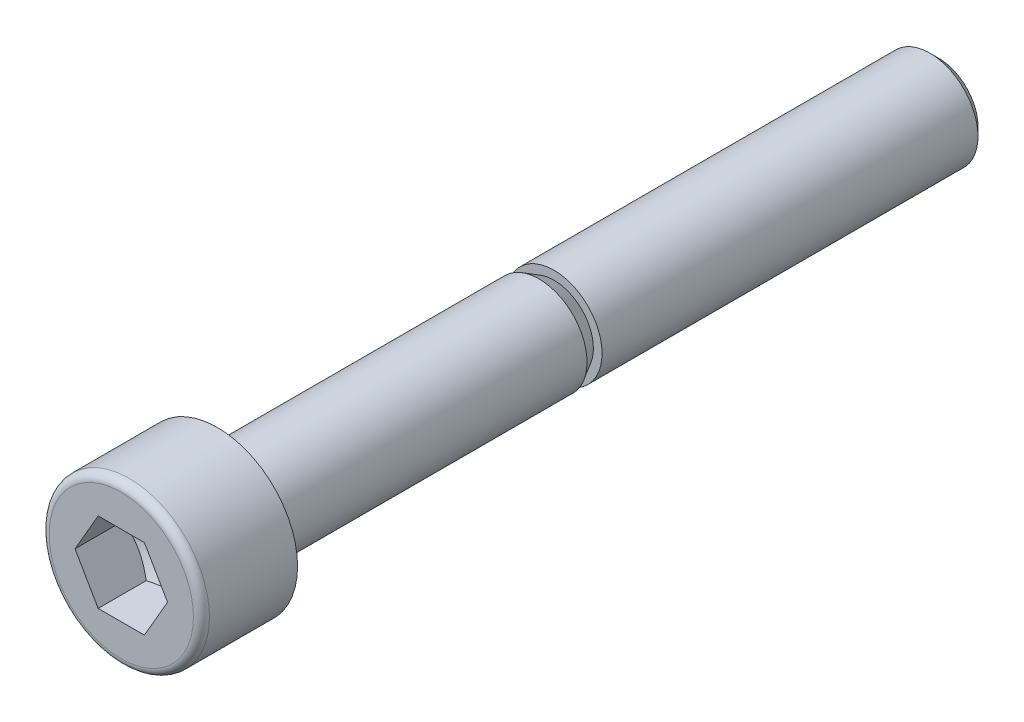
ISO-10303-21;
HEADER;
FILE_DESCRIPTION(('STEP AP214'),'2;1');
FILE_NAME('part.step','',(''),(''),'','','');
FILE_SCHEMA(('AUTOMOTIVE_DESIGN { 1 0 10303 214 1 1 1 1 }'));
ENDSEC;
DATA;
#1=APPLICATION_CONTEXT('core data for automotive mechanical design processes');
#2=APPLICATION_PROTOCOL_DEFINITION('international standard','automotive_design',2000,#1);
#3=PRODUCT_CONTEXT('',#1,'mechanical');
#4=PRODUCT('Part','Part','',(#3));
#5=PRODUCT_RELATED_PRODUCT_CATEGORY('part','',(#4));
#6=PRODUCT_DEFINITION_FORMATION('','',#4);
#7=PRODUCT_DEFINITION_CONTEXT('part definition',#1,'design');
#8=PRODUCT_DEFINITION('design','',#6,#7);
#9=PRODUCT_DEFINITION_SHAPE('','',#8);
#10=(LENGTH_UNIT() NAMED_UNIT(*) SI_UNIT(.MILLI.,.METRE.));
#11=(NAMED_UNIT(*) PLANE_ANGLE_UNIT() SI_UNIT($,.RADIAN.));
#12=(NAMED_UNIT(*) SI_UNIT($,.STERADIAN.) SOLID_ANGLE_UNIT());
#13=UNCERTAINTY_MEASURE_WITH_UNIT(LENGTH_MEASURE(1.E-05),#10,'distance_accuracy_value','');
#14=(GEOMETRIC_REPRESENTATION_CONTEXT(3) GLOBAL_UNCERTAINTY_ASSIGNED_CONTEXT((#13)) GLOBAL_UNIT_ASSIGNED_CONTEXT((#10,
#11,#12)) REPRESENTATION_CONTEXT('',''));
#15=CARTESIAN_POINT('',(0.,0.,0.));
#16=DIRECTION('',(0.,0.,1.));
#17=DIRECTION('',(1.,0.,0.));
#18=AXIS2_PLACEMENT_3D('',#15,#16,#17);
#19=CARTESIAN_POINT('',(0.,0.,6.));
#20=DIRECTION('',(0.,0.,1.));
#21=DIRECTION('',(1.,0.,0.));
#22=AXIS2_PLACEMENT_3D('',#19,#20,#21);
#23=PLANE('',#22);
#24=CARTESIAN_POINT('',(0.,0.,6.));
#25=DIRECTION('',(0.,0.,1.));
#26=DIRECTION('',(1.,0.,0.));
#27=AXIS2_PLACEMENT_3D('',#24,#25,#26);
#28=CIRCLE('',#27,4.5);
#29=CARTESIAN_POINT('',(4.5,0.,6.));
#30=VERTEX_POINT('',#29);
#31=EDGE_CURVE('E11',#30,#30,#28,.T.);
#32=ORIENTED_EDGE('',*,*,#31,.T.);
#33=EDGE_LOOP('',(#32));
#34=FACE_BOUND('',#33,.T.);
#35=DIRECTION('',(1.,0.,0.));
#36=VECTOR('',#35,1.);
#37=CARTESIAN_POINT('',(-1.443375,2.49999883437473,6.));
#38=LINE('',#37,#36);
#39=CARTESIAN_POINT('',(-1.443375,2.49999883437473,6.));
#40=VERTEX_POINT('',#39);
#41=CARTESIAN_POINT('',(1.443375,2.49999883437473,6.));
#42=VERTEX_POINT('',#41);
#43=EDGE_CURVE('E92',#40,#42,#38,.T.);
#44=ORIENTED_EDGE('',*,*,#43,.T.);
#45=DIRECTION('',(0.5,-0.866025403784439,0.));
#46=VECTOR('',#45,1.);
#47=CARTESIAN_POINT('',(1.443375,2.49999883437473,6.));
#48=LINE('',#47,#46);
#49=CARTESIAN_POINT('',(2.88675,0.,6.));
#50=VERTEX_POINT('',#49);
#51=EDGE_CURVE('E31',#42,#50,#48,.T.);
#52=ORIENTED_EDGE('',*,*,#51,.T.);
#53=DIRECTION('',(-0.5,-0.866025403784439,0.));
#54=VECTOR('',#53,1.);
#55=CARTESIAN_POINT('',(2.88675,0.,6.));
#56=LINE('',#55,#54);
#57=CARTESIAN_POINT('',(1.443375,-2.49999883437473,6.));
#58=VERTEX_POINT('',#57);
#59=EDGE_CURVE('E169',#50,#58,#56,.T.);
#60=ORIENTED_EDGE('',*,*,#59,.T.);
#61=DIRECTION('',(-1.,0.,0.));
#62=VECTOR('',#61,1.);
#63=CARTESIAN_POINT('',(1.443375,-2.49999883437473,6.));
#64=LINE('',#63,#62);
#65=CARTESIAN_POINT('',(-1.443375,-2.49999883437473,6.));
#66=VERTEX_POINT('',#65);
#67=EDGE_CURVE('E165',#58,#66,#64,.T.);
#68=ORIENTED_EDGE('',*,*,#67,.T.);
#69=DIRECTION('',(-0.5,0.866025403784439,0.));
#70=VECTOR('',#69,1.);
#71=CARTESIAN_POINT('',(-1.443375,-2.49999883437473,6.));
#72=LINE('',#71,#70);
#73=CARTESIAN_POINT('',(-2.88675,0.,6.));
#74=VERTEX_POINT('',#73);
#75=EDGE_CURVE('E160',#66,#74,#72,.T.);
#76=ORIENTED_EDGE('',*,*,#75,.T.);
#77=DIRECTION('',(0.5,0.866025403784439,0.));
#78=VECTOR('',#77,1.);
#79=CARTESIAN_POINT('',(-2.88675,0.,6.));
#80=LINE('',#79,#78);
#81=EDGE_CURVE('E96',#74,#40,#80,.T.);
#82=ORIENTED_EDGE('',*,*,#81,.T.);
#83=EDGE_LOOP('',(#44,#52,#60,#68,#76,#82));
#84=FACE_BOUND('',#83,.T.);
#85=ADVANCED_FACE('F17',(#34,#84),#23,.T.);
#86=CARTESIAN_POINT('',(0.,0.,5.5));
#87=DIRECTION('',(0.,0.,1.));
#88=DIRECTION('',(1.,0.,0.));
#89=AXIS2_PLACEMENT_3D('',#86,#87,#88);
#90=TOROIDAL_SURFACE('',#89,4.5,0.5);
#91=ORIENTED_EDGE('',*,*,#31,.F.);
#92=EDGE_LOOP('',(#91));
#93=FACE_BOUND('',#92,.T.);
#94=CARTESIAN_POINT('',(0.,0.,5.5));
#95=DIRECTION('',(0.,0.,1.));
#96=DIRECTION('',(1.,0.,0.));
#97=AXIS2_PLACEMENT_3D('',#94,#95,#96);
#98=CIRCLE('',#97,5.);
#99=CARTESIAN_POINT('',(5.,0.,5.5));
#100=VERTEX_POINT('',#99);
#101=EDGE_CURVE('E24',#100,#100,#98,.T.);
#102=ORIENTED_EDGE('',*,*,#101,.T.);
#103=EDGE_LOOP('',(#102));
#104=FACE_BOUND('',#103,.T.);
#105=ADVANCED_FACE('F133',(#93,#104),#90,.T.);
#106=CARTESIAN_POINT('',(0.,0.,6.));
#107=DIRECTION('',(0.,0.,1.));
#108=DIRECTION('',(1.,0.,0.));
#109=AXIS2_PLACEMENT_3D('',#106,#107,#108);
#110=CYLINDRICAL_SURFACE('',#109,5.);
#111=CARTESIAN_POINT('',(0.,0.,0.));
#112=DIRECTION('',(0.,0.,1.));
#113=DIRECTION('',(1.,0.,0.));
#114=AXIS2_PLACEMENT_3D('',#111,#112,#113);
#115=CIRCLE('',#114,5.);
#116=CARTESIAN_POINT('',(5.,0.,0.));
#117=VERTEX_POINT('',#116);
#118=EDGE_CURVE('E128',#117,#117,#115,.T.);
#119=ORIENTED_EDGE('',*,*,#118,.T.);
#120=EDGE_LOOP('',(#119));
#121=FACE_BOUND('',#120,.T.);
#122=ORIENTED_EDGE('',*,*,#101,.F.);
#123=EDGE_LOOP('',(#122));
#124=FACE_BOUND('',#123,.T.);
#125=ADVANCED_FACE('F135',(#121,#124),#110,.T.);
#126=CARTESIAN_POINT('',(0.,5.,0.));
#127=DIRECTION('',(0.,0.,-1.));
#128=DIRECTION('',(-1.,0.,0.));
#129=AXIS2_PLACEMENT_3D('',#126,#127,#128);
#130=PLANE('',#129);
#131=CARTESIAN_POINT('',(0.,0.,0.));
#132=DIRECTION('',(0.,0.,1.));
#133=DIRECTION('',(1.,0.,0.));
#134=AXIS2_PLACEMENT_3D('',#131,#132,#133);
#135=CIRCLE('',#134,3.3);
#136=CARTESIAN_POINT('',(3.3,0.,0.));
#137=VERTEX_POINT('',#136);
#138=EDGE_CURVE('E125',#137,#137,#135,.T.);
#139=ORIENTED_EDGE('',*,*,#138,.T.);
#140=EDGE_LOOP('',(#139));
#141=FACE_BOUND('',#140,.T.);
#142=ORIENTED_EDGE('',*,*,#118,.F.);
#143=EDGE_LOOP('',(#142));
#144=FACE_BOUND('',#143,.T.);
#145=ADVANCED_FACE('F137',(#141,#144),#130,.T.);
#146=CARTESIAN_POINT('',(0.,0.,-0.3));
#147=DIRECTION('',(0.,0.,1.));
#148=DIRECTION('',(1.,0.,0.));
#149=AXIS2_PLACEMENT_3D('',#146,#147,#148);
#150=TOROIDAL_SURFACE('',#149,3.3,0.3);
#151=CARTESIAN_POINT('',(0.,0.,-0.3));
#152=DIRECTION('',(0.,0.,1.));
#153=DIRECTION('',(1.,0.,0.));
#154=AXIS2_PLACEMENT_3D('',#151,#152,#153);
#155=CIRCLE('',#154,3.);
#156=CARTESIAN_POINT('',(3.,0.,-0.3));
#157=VERTEX_POINT('',#156);
#158=EDGE_CURVE('E122',#157,#157,#155,.T.);
#159=ORIENTED_EDGE('',*,*,#158,.T.);
#160=EDGE_LOOP('',(#159));
#161=FACE_BOUND('',#160,.T.);
#162=ORIENTED_EDGE('',*,*,#138,.F.);
#163=EDGE_LOOP('',(#162));
#164=FACE_BOUND('',#163,.T.);
#165=ADVANCED_FACE('F145',(#161,#164),#150,.F.);
#166=CARTESIAN_POINT('',(0.,0.,6.));
#167=DIRECTION('',(0.,0.,1.));
#168=DIRECTION('',(1.,0.,0.));
#169=AXIS2_PLACEMENT_3D('',#166,#167,#168);
#170=CYLINDRICAL_SURFACE('',#169,3.);
#171=CARTESIAN_POINT('',(0.,0.,-20.0625275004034));
#172=DIRECTION('',(0.,0.,1.));
#173=DIRECTION('',(1.,0.,0.));
#174=AXIS2_PLACEMENT_3D('',#171,#172,#173);
#175=CIRCLE('',#174,3.);
#176=CARTESIAN_POINT('',(3.,0.,-20.0625275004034));
#177=VERTEX_POINT('',#176);
#178=EDGE_CURVE('E119',#177,#177,#175,.T.);
#179=ORIENTED_EDGE('',*,*,#178,.T.);
#180=EDGE_LOOP('',(#179));
#181=FACE_BOUND('',#180,.T.);
#182=ORIENTED_EDGE('',*,*,#158,.F.);
#183=EDGE_LOOP('',(#182));
#184=FACE_BOUND('',#183,.T.);
#185=ADVANCED_FACE('F316',(#181,#184),#170,.T.);
#186=CARTESIAN_POINT('',(0.,0.,-20.0625275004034));
#187=DIRECTION('',(0.,0.,1.));
#188=DIRECTION('',(1.,0.,0.));
#189=AXIS2_PLACEMENT_3D('',#186,#187,#188);
#190=CONICAL_SURFACE('',#189,3.,0.523598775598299);
#191=CARTESIAN_POINT('',(0.,0.,-21.));
#192=DIRECTION('',(0.,0.,1.));
#193=DIRECTION('',(1.,0.,0.));
#194=AXIS2_PLACEMENT_3D('',#191,#192,#193);
#195=CIRCLE('',#194,2.45875);
#196=CARTESIAN_POINT('',(2.45875,0.,-21.));
#197=VERTEX_POINT('',#196);
#198=EDGE_CURVE('E116',#197,#197,#195,.T.);
#199=ORIENTED_EDGE('',*,*,#198,.T.);
#200=EDGE_LOOP('',(#199));
#201=FACE_BOUND('',#200,.T.);
#202=ORIENTED_EDGE('',*,*,#178,.F.);
#203=EDGE_LOOP('',(#202));
#204=FACE_BOUND('',#203,.T.);
#205=ADVANCED_FACE('F308',(#201,#204),#190,.T.);
#206=CARTESIAN_POINT('',(0.,2.45875,-21.));
#207=DIRECTION('',(0.,0.,1.));
#208=DIRECTION('',(1.,0.,0.));
#209=AXIS2_PLACEMENT_3D('',#206,#207,#208);
#210=PLANE('',#209);
#211=CARTESIAN_POINT('',(0.,0.,-21.));
#212=DIRECTION('',(0.,0.,1.));
#213=DIRECTION('',(1.,0.,0.));
#214=AXIS2_PLACEMENT_3D('',#211,#212,#213);
#215=CIRCLE('',#214,3.);
#216=CARTESIAN_POINT('',(3.,0.,-21.));
#217=VERTEX_POINT('',#216);
#218=EDGE_CURVE('E113',#217,#217,#215,.T.);
#219=ORIENTED_EDGE('',*,*,#218,.T.);
#220=EDGE_LOOP('',(#219));
#221=FACE_BOUND('',#220,.T.);
#222=ORIENTED_EDGE('',*,*,#198,.F.);
#223=EDGE_LOOP('',(#222));
#224=FACE_BOUND('',#223,.T.);
#225=ADVANCED_FACE('F298',(#221,#224),#210,.T.);
#226=CARTESIAN_POINT('',(0.,0.,6.));
#227=DIRECTION('',(0.,0.,1.));
#228=DIRECTION('',(1.,0.,0.));
#229=AXIS2_PLACEMENT_3D('',#226,#227,#228);
#230=CYLINDRICAL_SURFACE('',#229,3.);
#231=CARTESIAN_POINT('',(0.,0.,-44.45875));
#232=DIRECTION('',(0.,0.,1.));
#233=DIRECTION('',(1.,0.,0.));
#234=AXIS2_PLACEMENT_3D('',#231,#232,#233);
#235=CIRCLE('',#234,3.);
#236=CARTESIAN_POINT('',(3.,0.,-44.45875));
#237=VERTEX_POINT('',#236);
#238=EDGE_CURVE('E110',#237,#237,#235,.T.);
#239=ORIENTED_EDGE('',*,*,#238,.T.);
#240=EDGE_LOOP('',(#239));
#241=FACE_BOUND('',#240,.T.);
#242=ORIENTED_EDGE('',*,*,#218,.F.);
#243=EDGE_LOOP('',(#242));
#244=FACE_BOUND('',#243,.T.);
#245=ADVANCED_FACE('F288',(#241,#244),#230,.T.);
#246=CARTESIAN_POINT('',(0.,0.,-44.45875));
#247=DIRECTION('',(0.,0.,1.));
#248=DIRECTION('',(1.,0.,0.));
#249=AXIS2_PLACEMENT_3D('',#246,#247,#248);
#250=CONICAL_SURFACE('',#249,3.,0.78539816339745);
#251=CARTESIAN_POINT('',(0.,0.,-45.));
#252=DIRECTION('',(0.,0.,1.));
#253=DIRECTION('',(1.,0.,0.));
#254=AXIS2_PLACEMENT_3D('',#251,#252,#253);
#255=CIRCLE('',#254,2.45875);
#256=CARTESIAN_POINT('',(2.45875,0.,-45.));
#257=VERTEX_POINT('',#256);
#258=EDGE_CURVE('E107',#257,#257,#255,.T.);
#259=ORIENTED_EDGE('',*,*,#258,.T.);
#260=EDGE_LOOP('',(#259));
#261=FACE_BOUND('',#260,.T.);
#262=ORIENTED_EDGE('',*,*,#238,.F.);
#263=EDGE_LOOP('',(#262));
#264=FACE_BOUND('',#263,.T.);
#265=ADVANCED_FACE('F281',(#261,#264),#250,.T.);
#266=CARTESIAN_POINT('',(0.,2.45875,-45.));
#267=DIRECTION('',(0.,0.,-1.));
#268=DIRECTION('',(-1.,0.,0.));
#269=AXIS2_PLACEMENT_3D('',#266,#267,#268);
#270=PLANE('',#269);
#271=ORIENTED_EDGE('',*,*,#258,.F.);
#272=EDGE_LOOP('',(#271));
#273=FACE_BOUND('',#272,.T.);
#274=ADVANCED_FACE('F225',(#273),#270,.T.);
#275=CARTESIAN_POINT('',(1.443375,2.49999883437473,1.33333411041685));
#276=DIRECTION('',(-0.866025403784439,-0.5,0.));
#277=DIRECTION('',(-0.5,0.866025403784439,0.));
#278=AXIS2_PLACEMENT_3D('',#275,#276,#277);
#279=PLANE('',#278);
#280=DIRECTION('',(0.,0.,1.));
#281=VECTOR('',#280,1.);
#282=CARTESIAN_POINT('',(2.88675,0.,1.33333411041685));
#283=LINE('',#282,#281);
#284=CARTESIAN_POINT('',(2.88675,0.,3.));
#285=VERTEX_POINT('',#284);
#286=EDGE_CURVE('E105',#285,#50,#283,.T.);
#287=ORIENTED_EDGE('',*,*,#286,.T.);
#288=ORIENTED_EDGE('',*,*,#51,.F.);
#289=DIRECTION('',(0.,0.,1.));
#290=VECTOR('',#289,1.);
#291=CARTESIAN_POINT('',(1.443375,2.49999883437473,1.33333411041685));
#292=LINE('',#291,#290);
#293=CARTESIAN_POINT('',(1.443375,2.49999883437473,3.));
#294=VERTEX_POINT('',#293);
#295=EDGE_CURVE('E86',#294,#42,#292,.T.);
#296=ORIENTED_EDGE('',*,*,#295,.F.);
#297=CARTESIAN_POINT('',(2.88675011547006,-1.99999999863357E-07,3.00000006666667));
#298=CARTESIAN_POINT('',(2.82332252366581,0.109859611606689,2.96336950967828));
#299=CARTESIAN_POINT('',(2.75934742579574,0.22066773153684,2.93005593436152));
#300=CARTESIAN_POINT('',(2.63028954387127,0.444202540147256,2.87190808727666));
#301=CARTESIAN_POINT('',(2.56520446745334,0.556933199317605,2.84709438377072));
#302=CARTESIAN_POINT('',(2.43584088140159,0.780997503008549,2.80847006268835));
#303=CARTESIAN_POINT('',(2.37158227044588,0.892296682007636,2.7944023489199));
#304=CARTESIAN_POINT('',(2.24276284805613,1.11541846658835,2.77761157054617));
#305=CARTESIAN_POINT('',(2.17820250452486,1.22724026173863,2.77487459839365));
#306=CARTESIAN_POINT('',(2.05757841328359,1.43616731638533,2.78058295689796));
#307=CARTESIAN_POINT('',(2.00149656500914,1.53330392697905,2.7876266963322));
#308=CARTESIAN_POINT('',(1.8896982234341,1.72694433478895,2.80994670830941));
#309=CARTESIAN_POINT('',(1.83398211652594,1.82344746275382,2.82523059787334));
#310=CARTESIAN_POINT('',(1.72195345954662,2.01748678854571,2.86343736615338));
#311=CARTESIAN_POINT('',(1.66565508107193,2.11499844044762,2.88652212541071));
#312=CARTESIAN_POINT('',(1.55389777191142,2.3085677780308,2.93891477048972));
#313=CARTESIAN_POINT('',(1.49843741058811,2.40462794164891,2.96821035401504));
#314=CARTESIAN_POINT('',(1.44337488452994,2.49999903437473,3.00000006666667));
#315=B_SPLINE_CURVE_WITH_KNOTS('',3,(#297,#298,#299,#300,#301,#302,#303,#304,#305,#306,#307,
#308,#309,#310,#311,#312,#313,#314),.UNSPECIFIED.,.F.,.F.,(4,2,2,2,2,2,2,2,4),(0.,
0.396269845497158,0.793491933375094,1.18088400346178,1.56780044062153,1.90463400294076,
2.24177946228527,2.58640119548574,2.93034658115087),.UNSPECIFIED.);
#316=EDGE_CURVE('E79',#285,#294,#315,.T.);
#317=ORIENTED_EDGE('',*,*,#316,.F.);
#318=EDGE_LOOP('',(#287,#288,#296,#317));
#319=FACE_BOUND('',#318,.T.);
#320=ADVANCED_FACE('F87',(#319),#279,.T.);
#321=CARTESIAN_POINT('',(2.88675,0.,1.33333411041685));
#322=DIRECTION('',(-0.866025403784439,0.5,0.));
#323=DIRECTION('',(0.5,0.866025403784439,0.));
#324=AXIS2_PLACEMENT_3D('',#321,#322,#323);
#325=PLANE('',#324);
#326=DIRECTION('',(0.,0.,1.));
#327=VECTOR('',#326,1.);
#328=CARTESIAN_POINT('',(1.443375,-2.49999883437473,1.33333411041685));
#329=LINE('',#328,#327);
#330=CARTESIAN_POINT('',(1.443375,-2.49999883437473,3.));
#331=VERTEX_POINT('',#330);
#332=EDGE_CURVE('E103',#331,#58,#329,.T.);
#333=ORIENTED_EDGE('',*,*,#332,.T.);
#334=ORIENTED_EDGE('',*,*,#59,.F.);
#335=ORIENTED_EDGE('',*,*,#286,.F.);
#336=CARTESIAN_POINT('',(1.44337488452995,-2.49999903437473,3.00000006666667));
#337=CARTESIAN_POINT('',(1.50680247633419,-2.39013922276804,2.96336950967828));
#338=CARTESIAN_POINT('',(1.57077757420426,-2.27933110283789,2.93005593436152));
#339=CARTESIAN_POINT('',(1.69983545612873,-2.05579629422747,2.87190808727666));
#340=CARTESIAN_POINT('',(1.76492053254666,-1.94306563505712,2.84709438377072));
#341=CARTESIAN_POINT('',(1.89428411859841,-1.71900133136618,2.80847006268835));
#342=CARTESIAN_POINT('',(1.95854272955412,-1.60770215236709,2.7944023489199));
#343=CARTESIAN_POINT('',(2.08736215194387,-1.38458036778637,2.77761157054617));
#344=CARTESIAN_POINT('',(2.15192249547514,-1.2727585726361,2.77487459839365));
#345=CARTESIAN_POINT('',(2.27254658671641,-1.06383151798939,2.78058295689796));
#346=CARTESIAN_POINT('',(2.32862843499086,-0.966694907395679,2.7876266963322));
#347=CARTESIAN_POINT('',(2.4404267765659,-0.773054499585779,2.8099467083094));
#348=CARTESIAN_POINT('',(2.49614288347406,-0.676551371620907,2.82523059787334));
#349=CARTESIAN_POINT('',(2.60817154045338,-0.48251204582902,2.86343736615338));
#350=CARTESIAN_POINT('',(2.66446991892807,-0.385000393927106,2.88652212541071));
#351=CARTESIAN_POINT('',(2.77622722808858,-0.191431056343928,2.93891477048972));
#352=CARTESIAN_POINT('',(2.83168758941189,-0.0953708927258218,2.96821035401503));
#353=CARTESIAN_POINT('',(2.88675011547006,1.99999999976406E-07,3.00000006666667));
#354=B_SPLINE_CURVE_WITH_KNOTS('',3,(#336,#337,#338,#339,#340,#341,#342,#343,#344,#345,#346,
#347,#348,#349,#350,#351,#352,#353),.UNSPECIFIED.,.F.,.F.,(4,2,2,2,2,2,2,2,4),(0.,
0.396269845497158,0.793491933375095,1.18088400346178,1.56780044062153,1.90463400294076,
2.24177946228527,2.58640119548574,2.93034658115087),.UNSPECIFIED.);
#355=EDGE_CURVE('E83',#331,#285,#354,.T.);
#356=ORIENTED_EDGE('',*,*,#355,.F.);
#357=EDGE_LOOP('',(#333,#334,#335,#356));
#358=FACE_BOUND('',#357,.T.);
#359=ADVANCED_FACE('F216',(#358),#325,.T.);
#360=CARTESIAN_POINT('',(1.443375,-2.49999883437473,1.33333411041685));
#361=DIRECTION('',(0.,1.,0.));
#362=DIRECTION('',(1.,0.,0.));
#363=AXIS2_PLACEMENT_3D('',#360,#361,#362);
#364=PLANE('',#363);
#365=DIRECTION('',(0.,0.,1.));
#366=VECTOR('',#365,1.);
#367=CARTESIAN_POINT('',(-1.443375,-2.49999883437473,1.33333411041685));
#368=LINE('',#367,#366);
#369=CARTESIAN_POINT('',(-1.443375,-2.49999883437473,3.));
#370=VERTEX_POINT('',#369);
#371=EDGE_CURVE('E101',#370,#66,#368,.T.);
#372=ORIENTED_EDGE('',*,*,#371,.T.);
#373=ORIENTED_EDGE('',*,*,#67,.F.);
#374=ORIENTED_EDGE('',*,*,#332,.F.);
#375=CARTESIAN_POINT('',(-3.73786106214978,-2.49999883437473,3.92958778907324));
#376=CARTESIAN_POINT('',(-3.62990250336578,-2.49999883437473,3.87779335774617));
#377=CARTESIAN_POINT('',(-3.52168094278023,-2.49999883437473,3.82653690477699));
#378=CARTESIAN_POINT('',(-3.30457164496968,-2.49999883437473,3.72540514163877));
#379=CARTESIAN_POINT('',(-3.1956837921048,-2.49999883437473,3.67553008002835));
#380=CARTESIAN_POINT('',(-2.97647740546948,-2.49999883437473,3.57718765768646));
#381=CARTESIAN_POINT('',(-2.86615419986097,-2.49999883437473,3.52873067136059));
#382=CARTESIAN_POINT('',(-2.64458202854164,-2.49999883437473,3.43398963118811));
#383=CARTESIAN_POINT('',(-2.5333331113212,-2.49999883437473,3.38770546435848));
#384=CARTESIAN_POINT('',(-2.30680205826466,-2.49999883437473,3.29671007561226));
#385=CARTESIAN_POINT('',(-2.19149052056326,-2.49999883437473,3.25207161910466));
#386=CARTESIAN_POINT('',(-1.95947266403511,-2.49999883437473,3.16650598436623));
#387=CARTESIAN_POINT('',(-1.84276618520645,-2.49999883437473,3.12557923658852));
#388=CARTESIAN_POINT('',(-1.60804233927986,-2.49999883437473,3.04860739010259));
#389=CARTESIAN_POINT('',(-1.49002871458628,-2.49999883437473,3.01255100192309));
#390=CARTESIAN_POINT('',(-1.25231014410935,-2.49999883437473,2.94655294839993));
#391=CARTESIAN_POINT('',(-1.13260562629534,-2.49999883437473,2.91660976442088));
#392=CARTESIAN_POINT('',(-0.891754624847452,-2.49999883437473,2.86443431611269));
#393=CARTESIAN_POINT('',(-0.770611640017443,-2.49999883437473,2.84218621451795));
#394=CARTESIAN_POINT('',(-0.526970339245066,-2.49999883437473,2.80685777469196));
#395=CARTESIAN_POINT('',(-0.404472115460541,-2.49999883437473,2.79377681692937));
#396=CARTESIAN_POINT('',(-0.160266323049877,-2.49999883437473,2.77799632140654));
#397=CARTESIAN_POINT('',(-0.0385668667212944,-2.49999883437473,2.77517427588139));
#398=CARTESIAN_POINT('',(0.204641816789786,-2.49999883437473,2.77983589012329));
#399=CARTESIAN_POINT('',(0.326151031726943,-2.49999883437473,2.78732018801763));
#400=CARTESIAN_POINT('',(0.536550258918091,-2.49999883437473,2.80869871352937));
#401=CARTESIAN_POINT('',(0.62567290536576,-2.49999883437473,2.82040889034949));
#402=CARTESIAN_POINT('',(0.803172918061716,-2.49999883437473,2.84856827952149));
#403=CARTESIAN_POINT('',(0.891550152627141,-2.49999883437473,2.86501831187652));
#404=CARTESIAN_POINT('',(1.15551819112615,-2.49999883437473,2.92060817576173));
#405=CARTESIAN_POINT('',(1.32980784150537,-2.49999883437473,2.96597208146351));
#406=CARTESIAN_POINT('',(1.59042319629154,-2.49999883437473,3.04347409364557));
#407=CARTESIAN_POINT('',(1.67812270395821,-2.49999883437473,3.07124565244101));
#408=CARTESIAN_POINT('',(1.85261386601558,-2.49999883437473,3.12935698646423));
#409=CARTESIAN_POINT('',(1.93940604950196,-2.49999883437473,3.15969515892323));
#410=CARTESIAN_POINT('',(2.11219208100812,-2.49999883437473,3.22250012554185));
#411=CARTESIAN_POINT('',(2.19818607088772,-2.49999883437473,3.25496653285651));
#412=CARTESIAN_POINT('',(2.36949689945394,-2.49999883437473,3.32167630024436));
#413=CARTESIAN_POINT('',(2.45481362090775,-2.49999883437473,3.3559199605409));
#414=CARTESIAN_POINT('',(2.67258663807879,-2.49999883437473,3.44552247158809));
#415=CARTESIAN_POINT('',(2.80460718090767,-2.49999883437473,3.50193902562));
#416=CARTESIAN_POINT('',(3.06745885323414,-2.49999883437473,3.61748625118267));
#417=CARTESIAN_POINT('',(3.19828989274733,-2.49999883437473,3.67661712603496));
#418=CARTESIAN_POINT('',(3.45900849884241,-2.49999883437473,3.79697660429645));
#419=CARTESIAN_POINT('',(3.58889589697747,-2.49999883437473,3.85820557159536));
#420=CARTESIAN_POINT('',(3.84788845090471,-2.49999883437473,3.98229868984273));
#421=CARTESIAN_POINT('',(3.97699358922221,-2.49999883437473,4.04516287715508));
#422=CARTESIAN_POINT('',(4.36366789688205,-2.49999883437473,4.2358316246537));
#423=CARTESIAN_POINT('',(4.62028438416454,-2.49999883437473,4.36556637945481));
#424=CARTESIAN_POINT('',(5.1317603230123,-2.49999883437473,4.62835381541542));
#425=CARTESIAN_POINT('',(5.3866199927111,-2.49999883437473,4.76140607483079));
#426=CARTESIAN_POINT('',(5.87112445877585,-2.49999883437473,5.01714627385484));
#427=CARTESIAN_POINT('',(6.10087872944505,-2.49999883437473,5.13962714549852));
#428=CARTESIAN_POINT('',(6.55964828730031,-2.49999883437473,5.3859833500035));
#429=CARTESIAN_POINT('',(6.78866354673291,-2.49999883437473,5.5098587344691));
#430=CARTESIAN_POINT('',(7.24554286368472,-2.49999883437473,5.75833893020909));
#431=CARTESIAN_POINT('',(7.47340836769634,-2.49999883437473,5.88294108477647));
#432=CARTESIAN_POINT('',(7.92867868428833,-2.49999883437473,6.13295637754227));
#433=CARTESIAN_POINT('',(8.15608352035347,-2.49999883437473,6.25836947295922));
#434=CARTESIAN_POINT('',(8.38332285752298,-2.49999883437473,6.38407980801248));
#435=B_SPLINE_CURVE_WITH_KNOTS('',3,(#375,#376,#377,#378,#379,#380,#381,#382,#383,#384,#385,
#386,#387,#388,#389,#390,#391,#392,#393,#394,#395,#396,#397,#398,#399,#400,#401,#402,#403,#404,
#405,#406,#407,#408,#409,#410,#411,#412,#413,#414,#415,#416,#417,#418,#419,#420,#421,#422,#423,
#424,#425,#426,#427,#428,#429,#430,#431,#432,#433,#434),.UNSPECIFIED.,.F.,.F.,(4,2,2,2,2,2,2,2,
2,2,2,2,2,2,2,2,2,2,2,2,2,2,2,2,2,2,2,2,2,4),(0.,0.359225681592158,0.718515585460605,
1.07998495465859,1.44143550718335,1.81233642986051,2.18328031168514,2.55334902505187,
2.92332569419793,3.29253631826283,3.66172198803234,4.02648423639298,4.39126907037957,
4.66080188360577,4.93038135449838,5.46995360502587,5.74590907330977,6.02169347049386,
6.29742787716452,6.5732090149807,7.00387398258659,7.43457126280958,7.86534362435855,
8.29612557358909,9.15872149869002,10.0212083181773,10.8022890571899,11.583398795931,
12.3625217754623,13.1416039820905),.UNSPECIFIED.);
#436=EDGE_CURVE('E207',#370,#331,#435,.T.);
#437=ORIENTED_EDGE('',*,*,#436,.F.);
#438=EDGE_LOOP('',(#372,#373,#374,#437));
#439=FACE_BOUND('',#438,.T.);
#440=ADVANCED_FACE('F212',(#439),#364,.T.);
#441=CARTESIAN_POINT('',(-1.443375,-2.49999883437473,1.33333411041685));
#442=DIRECTION('',(0.866025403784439,0.5,0.));
#443=DIRECTION('',(0.5,-0.866025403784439,0.));
#444=AXIS2_PLACEMENT_3D('',#441,#442,#443);
#445=PLANE('',#444);
#446=DIRECTION('',(0.,0.,1.));
#447=VECTOR('',#446,1.);
#448=CARTESIAN_POINT('',(-2.88675,0.,1.33333411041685));
#449=LINE('',#448,#447);
#450=CARTESIAN_POINT('',(-2.88675,0.,3.));
#451=VERTEX_POINT('',#450);
#452=EDGE_CURVE('E94',#451,#74,#449,.T.);
#453=ORIENTED_EDGE('',*,*,#452,.T.);
#454=ORIENTED_EDGE('',*,*,#75,.F.);
#455=ORIENTED_EDGE('',*,*,#371,.F.);
#456=CARTESIAN_POINT('',(-2.88675011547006,2.E-07,3.00000006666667));
#457=CARTESIAN_POINT('',(-2.82332252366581,-0.109859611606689,2.96336950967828));
#458=CARTESIAN_POINT('',(-2.75934742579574,-0.220667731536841,2.93005593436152));
#459=CARTESIAN_POINT('',(-2.63028954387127,-0.444202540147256,2.87190808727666));
#460=CARTESIAN_POINT('',(-2.56520446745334,-0.556933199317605,2.84709438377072));
#461=CARTESIAN_POINT('',(-2.43584088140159,-0.780997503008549,2.80847006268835));
#462=CARTESIAN_POINT('',(-2.37158227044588,-0.892296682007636,2.7944023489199));
#463=CARTESIAN_POINT('',(-2.24276284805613,-1.11541846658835,2.77761157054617));
#464=CARTESIAN_POINT('',(-2.17820250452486,-1.22724026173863,2.77487459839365));
#465=CARTESIAN_POINT('',(-2.05757841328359,-1.43616731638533,2.78058295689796));
#466=CARTESIAN_POINT('',(-2.00149656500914,-1.53330392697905,2.7876266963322));
#467=CARTESIAN_POINT('',(-1.8896982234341,-1.72694433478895,2.8099467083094));
#468=CARTESIAN_POINT('',(-1.83398211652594,-1.82344746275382,2.82523059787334));
#469=CARTESIAN_POINT('',(-1.72195345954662,-2.01748678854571,2.86343736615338));
#470=CARTESIAN_POINT('',(-1.66565508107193,-2.11499844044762,2.88652212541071));
#471=CARTESIAN_POINT('',(-1.55389777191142,-2.3085677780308,2.93891477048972));
#472=CARTESIAN_POINT('',(-1.49843741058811,-2.40462794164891,2.96821035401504));
#473=CARTESIAN_POINT('',(-1.44337488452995,-2.49999903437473,3.00000006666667));
#474=B_SPLINE_CURVE_WITH_KNOTS('',3,(#456,#457,#458,#459,#460,#461,#462,#463,#464,#465,#466,
#467,#468,#469,#470,#471,#472,#473),.UNSPECIFIED.,.F.,.F.,(4,2,2,2,2,2,2,2,4),(0.,
0.396269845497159,0.793491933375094,1.18088400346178,1.56780044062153,1.90463400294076,
2.24177946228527,2.58640119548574,2.93034658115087),.UNSPECIFIED.);
#475=EDGE_CURVE('E202',#451,#370,#474,.T.);
#476=ORIENTED_EDGE('',*,*,#475,.F.);
#477=EDGE_LOOP('',(#453,#454,#455,#476));
#478=FACE_BOUND('',#477,.T.);
#479=ADVANCED_FACE('F215',(#478),#445,.T.);
#480=CARTESIAN_POINT('',(-2.88675,0.,1.33333411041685));
#481=DIRECTION('',(0.866025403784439,-0.5,0.));
#482=DIRECTION('',(-0.5,-0.866025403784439,0.));
#483=AXIS2_PLACEMENT_3D('',#480,#481,#482);
#484=PLANE('',#483);
#485=DIRECTION('',(0.,0.,1.));
#486=VECTOR('',#485,1.);
#487=CARTESIAN_POINT('',(-1.443375,2.49999883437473,1.33333411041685));
#488=LINE('',#487,#486);
#489=CARTESIAN_POINT('',(-1.443375,2.49999883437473,3.));
#490=VERTEX_POINT('',#489);
#491=EDGE_CURVE('E91',#490,#40,#488,.T.);
#492=ORIENTED_EDGE('',*,*,#491,.T.);
#493=ORIENTED_EDGE('',*,*,#81,.F.);
#494=ORIENTED_EDGE('',*,*,#452,.F.);
#495=CARTESIAN_POINT('',(-1.44337488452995,2.49999903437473,3.00000006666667));
#496=CARTESIAN_POINT('',(-1.50680247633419,2.39013922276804,2.96336950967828));
#497=CARTESIAN_POINT('',(-1.57077757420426,2.27933110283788,2.93005593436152));
#498=CARTESIAN_POINT('',(-1.69983545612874,2.05579629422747,2.87190808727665));
#499=CARTESIAN_POINT('',(-1.76492053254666,1.94306563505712,2.84709438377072));
#500=CARTESIAN_POINT('',(-1.89428411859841,1.71900133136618,2.80847006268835));
#501=CARTESIAN_POINT('',(-1.95854272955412,1.60770215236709,2.7944023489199));
#502=CARTESIAN_POINT('',(-2.08736215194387,1.38458036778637,2.77761157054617));
#503=CARTESIAN_POINT('',(-2.15192249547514,1.2727585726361,2.77487459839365));
#504=CARTESIAN_POINT('',(-2.27254658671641,1.06383151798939,2.78058295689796));
#505=CARTESIAN_POINT('',(-2.32862843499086,0.966694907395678,2.7876266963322));
#506=CARTESIAN_POINT('',(-2.4404267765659,0.773054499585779,2.8099467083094));
#507=CARTESIAN_POINT('',(-2.49614288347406,0.676551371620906,2.82523059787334));
#508=CARTESIAN_POINT('',(-2.60817154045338,0.48251204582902,2.86343736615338));
#509=CARTESIAN_POINT('',(-2.66446991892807,0.385000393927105,2.88652212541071));
#510=CARTESIAN_POINT('',(-2.77622722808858,0.191431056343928,2.93891477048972));
#511=CARTESIAN_POINT('',(-2.83168758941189,0.0953708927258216,2.96821035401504));
#512=CARTESIAN_POINT('',(-2.88675011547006,-2.00000000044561E-07,3.00000006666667));
#513=B_SPLINE_CURVE_WITH_KNOTS('',3,(#495,#496,#497,#498,#499,#500,#501,#502,#503,#504,#505,
#506,#507,#508,#509,#510,#511,#512),.UNSPECIFIED.,.F.,.F.,(4,2,2,2,2,2,2,2,4),(0.,
0.396269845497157,0.793491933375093,1.18088400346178,1.56780044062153,1.90463400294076,
2.24177946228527,2.58640119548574,2.93034658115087),.UNSPECIFIED.);
#514=EDGE_CURVE('E39',#490,#451,#513,.T.);
#515=ORIENTED_EDGE('',*,*,#514,.F.);
#516=EDGE_LOOP('',(#492,#493,#494,#515));
#517=FACE_BOUND('',#516,.T.);
#518=ADVANCED_FACE('F159',(#517),#484,.T.);
#519=CARTESIAN_POINT('',(-1.443375,2.49999883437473,1.33333411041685));
#520=DIRECTION('',(0.,-1.,0.));
#521=DIRECTION('',(-1.,0.,0.));
#522=AXIS2_PLACEMENT_3D('',#519,#520,#521);
#523=PLANE('',#522);
#524=ORIENTED_EDGE('',*,*,#295,.T.);
#525=ORIENTED_EDGE('',*,*,#43,.F.);
#526=ORIENTED_EDGE('',*,*,#491,.F.);
#527=CARTESIAN_POINT('',(-3.73786106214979,2.49999883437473,3.92958778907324));
#528=CARTESIAN_POINT('',(-3.62990250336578,2.49999883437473,3.87779335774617));
#529=CARTESIAN_POINT('',(-3.52168094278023,2.49999883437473,3.82653690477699));
#530=CARTESIAN_POINT('',(-3.30457164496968,2.49999883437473,3.72540514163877));
#531=CARTESIAN_POINT('',(-3.1956837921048,2.49999883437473,3.67553008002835));
#532=CARTESIAN_POINT('',(-2.97647740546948,2.49999883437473,3.57718765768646));
#533=CARTESIAN_POINT('',(-2.86615419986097,2.49999883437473,3.5287306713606));
#534=CARTESIAN_POINT('',(-2.64458202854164,2.49999883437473,3.43398963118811));
#535=CARTESIAN_POINT('',(-2.53333311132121,2.49999883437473,3.38770546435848));
#536=CARTESIAN_POINT('',(-2.30680205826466,2.49999883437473,3.29671007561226));
#537=CARTESIAN_POINT('',(-2.19149052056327,2.49999883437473,3.25207161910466));
#538=CARTESIAN_POINT('',(-1.95947266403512,2.49999883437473,3.16650598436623));
#539=CARTESIAN_POINT('',(-1.84276618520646,2.49999883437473,3.12557923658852));
#540=CARTESIAN_POINT('',(-1.60804233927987,2.49999883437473,3.04860739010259));
#541=CARTESIAN_POINT('',(-1.49002871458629,2.49999883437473,3.01255100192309));
#542=CARTESIAN_POINT('',(-1.25231014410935,2.49999883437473,2.94655294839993));
#543=CARTESIAN_POINT('',(-1.13260562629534,2.49999883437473,2.91660976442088));
#544=CARTESIAN_POINT('',(-0.891754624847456,2.49999883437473,2.86443431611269));
#545=CARTESIAN_POINT('',(-0.770611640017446,2.49999883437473,2.84218621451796));
#546=CARTESIAN_POINT('',(-0.526970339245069,2.49999883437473,2.80685777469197));
#547=CARTESIAN_POINT('',(-0.404472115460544,2.49999883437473,2.79377681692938));
#548=CARTESIAN_POINT('',(-0.160266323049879,2.49999883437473,2.77799632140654));
#549=CARTESIAN_POINT('',(-0.0385668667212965,2.49999883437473,2.77517427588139));
#550=CARTESIAN_POINT('',(0.204641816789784,2.49999883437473,2.77983589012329));
#551=CARTESIAN_POINT('',(0.326151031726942,2.49999883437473,2.78732018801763));
#552=CARTESIAN_POINT('',(0.536550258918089,2.49999883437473,2.80869871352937));
#553=CARTESIAN_POINT('',(0.625672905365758,2.49999883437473,2.82040889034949));
#554=CARTESIAN_POINT('',(0.803172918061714,2.49999883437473,2.84856827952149));
#555=CARTESIAN_POINT('',(0.891550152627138,2.49999883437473,2.86501831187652));
#556=CARTESIAN_POINT('',(1.15551819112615,2.49999883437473,2.92060817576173));
#557=CARTESIAN_POINT('',(1.32980784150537,2.49999883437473,2.96597208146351));
#558=CARTESIAN_POINT('',(1.59042319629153,2.49999883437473,3.04347409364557));
#559=CARTESIAN_POINT('',(1.67812270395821,2.49999883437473,3.07124565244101));
#560=CARTESIAN_POINT('',(1.85261386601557,2.49999883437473,3.12935698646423));
#561=CARTESIAN_POINT('',(1.93940604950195,2.49999883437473,3.15969515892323));
#562=CARTESIAN_POINT('',(2.11219208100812,2.49999883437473,3.22250012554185));
#563=CARTESIAN_POINT('',(2.19818607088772,2.49999883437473,3.25496653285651));
#564=CARTESIAN_POINT('',(2.36949689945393,2.49999883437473,3.32167630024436));
#565=CARTESIAN_POINT('',(2.45481362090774,2.49999883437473,3.3559199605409));
#566=CARTESIAN_POINT('',(2.67258663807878,2.49999883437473,3.44552247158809));
#567=CARTESIAN_POINT('',(2.80460718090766,2.49999883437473,3.50193902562));
#568=CARTESIAN_POINT('',(3.06745885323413,2.49999883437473,3.61748625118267));
#569=CARTESIAN_POINT('',(3.19828989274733,2.49999883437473,3.67661712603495));
#570=CARTESIAN_POINT('',(3.45900849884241,2.49999883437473,3.79697660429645));
#571=CARTESIAN_POINT('',(3.58889589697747,2.49999883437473,3.85820557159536));
#572=CARTESIAN_POINT('',(3.84788845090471,2.49999883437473,3.98229868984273));
#573=CARTESIAN_POINT('',(3.97699358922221,2.49999883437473,4.04516287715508));
#574=CARTESIAN_POINT('',(4.36366789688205,2.49999883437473,4.2358316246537));
#575=CARTESIAN_POINT('',(4.62028438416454,2.49999883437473,4.36556637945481));
#576=CARTESIAN_POINT('',(5.1317603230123,2.49999883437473,4.62835381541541));
#577=CARTESIAN_POINT('',(5.38661999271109,2.49999883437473,4.76140607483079));
#578=CARTESIAN_POINT('',(5.87112445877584,2.49999883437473,5.01714627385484));
#579=CARTESIAN_POINT('',(6.10087872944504,2.49999883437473,5.13962714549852));
#580=CARTESIAN_POINT('',(6.5596482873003,2.49999883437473,5.3859833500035));
#581=CARTESIAN_POINT('',(6.7886635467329,2.49999883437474,5.5098587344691));
#582=CARTESIAN_POINT('',(7.24554286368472,2.49999883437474,5.75833893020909));
#583=CARTESIAN_POINT('',(7.47340836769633,2.49999883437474,5.88294108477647));
#584=CARTESIAN_POINT('',(7.92867868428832,2.49999883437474,6.13295637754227));
#585=CARTESIAN_POINT('',(8.15608352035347,2.49999883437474,6.25836947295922));
#586=CARTESIAN_POINT('',(8.38332285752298,2.49999883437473,6.38407980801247));
#587=B_SPLINE_CURVE_WITH_KNOTS('',3,(#527,#528,#529,#530,#531,#532,#533,#534,#535,#536,#537,
#538,#539,#540,#541,#542,#543,#544,#545,#546,#547,#548,#549,#550,#551,#552,#553,#554,#555,#556,
#557,#558,#559,#560,#561,#562,#563,#564,#565,#566,#567,#568,#569,#570,#571,#572,#573,#574,#575,
#576,#577,#578,#579,#580,#581,#582,#583,#584,#585,#586),.UNSPECIFIED.,.F.,.F.,(4,2,2,2,2,2,2,2,
2,2,2,2,2,2,2,2,2,2,2,2,2,2,2,2,2,2,2,2,2,4),(0.,0.359225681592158,0.718515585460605,
1.07998495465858,1.44143550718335,1.81233642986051,2.18328031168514,2.55334902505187,
2.92332569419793,3.29253631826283,3.66172198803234,4.02648423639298,4.39126907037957,
4.66080188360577,4.93038135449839,5.46995360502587,5.74590907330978,6.02169347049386,
6.29742787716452,6.5732090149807,7.00387398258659,7.43457126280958,7.86534362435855,
8.29612557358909,9.15872149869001,10.0212083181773,10.8022890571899,11.583398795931,
12.3625217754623,13.1416039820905),.UNSPECIFIED.);
#588=EDGE_CURVE('E80',#294,#490,#587,.F.);
#589=ORIENTED_EDGE('',*,*,#588,.F.);
#590=EDGE_LOOP('',(#524,#525,#526,#589));
#591=FACE_BOUND('',#590,.T.);
#592=ADVANCED_FACE('F75',(#591),#523,.T.);
#593=CARTESIAN_POINT('',(0.,0.,1.33333411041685));
#594=DIRECTION('',(0.,0.,1.));
#595=DIRECTION('',(1.,0.,0.));
#596=AXIS2_PLACEMENT_3D('',#593,#594,#595);
#597=CONICAL_SURFACE('',#596,0.,1.0471975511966);
#598=CARTESIAN_POINT('',(0.,0.,1.33333411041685));
#599=VERTEX_POINT('',#598);
#600=VERTEX_LOOP('',#599);
#601=FACE_BOUND('',#600,.T.);
#602=ORIENTED_EDGE('',*,*,#316,.T.);
#603=ORIENTED_EDGE('',*,*,#588,.T.);
#604=ORIENTED_EDGE('',*,*,#514,.T.);
#605=ORIENTED_EDGE('',*,*,#475,.T.);
#606=ORIENTED_EDGE('',*,*,#436,.T.);
#607=ORIENTED_EDGE('',*,*,#355,.T.);
#608=EDGE_LOOP('',(#602,#603,#604,#605,#606,#607));
#609=FACE_BOUND('',#608,.T.);
#610=ADVANCED_FACE('F72',(#601,#609),#597,.F.);
#611=CLOSED_SHELL('',(#85,#105,#125,#145,#165,#185,#205,#225,#245,#265,#274,#320,#359,#440,#479,
#518,#592,#610));
#612=MANIFOLD_SOLID_BREP('B1',#611);
#613=ADVANCED_BREP_SHAPE_REPRESENTATION('',(#18,#612),#14);
#614=SHAPE_DEFINITION_REPRESENTATION(#9,#613);
ENDSEC;
END-ISO-10303-21;
